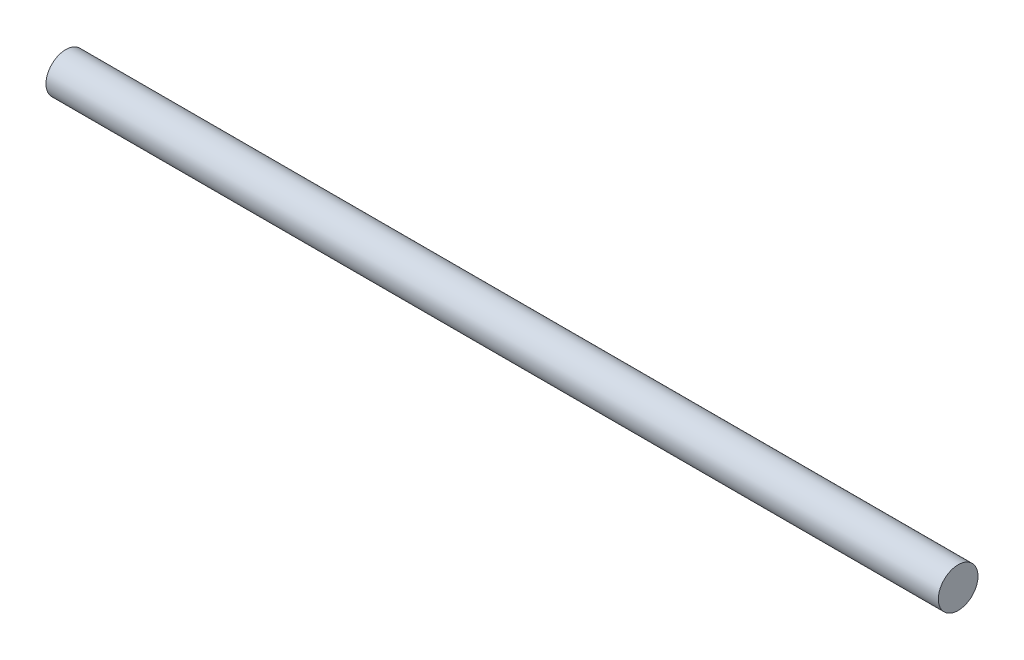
ISO-10303-21;
HEADER;
FILE_DESCRIPTION(('STEP AP214'),'2;1');
FILE_NAME('part.step','',(''),(''),'','','');
FILE_SCHEMA(('AUTOMOTIVE_DESIGN { 1 0 10303 214 1 1 1 1 }'));
ENDSEC;
DATA;
#1=APPLICATION_CONTEXT('core data for automotive mechanical design processes');
#2=APPLICATION_PROTOCOL_DEFINITION('international standard','automotive_design',2000,#1);
#3=PRODUCT_CONTEXT('',#1,'mechanical');
#4=PRODUCT('Part','Part','',(#3));
#5=PRODUCT_RELATED_PRODUCT_CATEGORY('part','',(#4));
#6=PRODUCT_DEFINITION_FORMATION('','',#4);
#7=PRODUCT_DEFINITION_CONTEXT('part definition',#1,'design');
#8=PRODUCT_DEFINITION('design','',#6,#7);
#9=PRODUCT_DEFINITION_SHAPE('','',#8);
#10=(LENGTH_UNIT() NAMED_UNIT(*) SI_UNIT(.MILLI.,.METRE.));
#11=(NAMED_UNIT(*) PLANE_ANGLE_UNIT() SI_UNIT($,.RADIAN.));
#12=(NAMED_UNIT(*) SI_UNIT($,.STERADIAN.) SOLID_ANGLE_UNIT());
#13=UNCERTAINTY_MEASURE_WITH_UNIT(LENGTH_MEASURE(1.E-05),#10,'distance_accuracy_value','');
#14=(GEOMETRIC_REPRESENTATION_CONTEXT(3) GLOBAL_UNCERTAINTY_ASSIGNED_CONTEXT((#13)) GLOBAL_UNIT_ASSIGNED_CONTEXT((#10,
#11,#12)) REPRESENTATION_CONTEXT('',''));
#15=CARTESIAN_POINT('',(0.,0.,0.));
#16=DIRECTION('',(0.,0.,1.));
#17=DIRECTION('',(1.,0.,0.));
#18=AXIS2_PLACEMENT_3D('',#15,#16,#17);
#19=CARTESIAN_POINT('',(270.,0.,0.));
#20=DIRECTION('',(-1.,0.,0.));
#21=DIRECTION('',(0.,0.,1.));
#22=AXIS2_PLACEMENT_3D('',#19,#20,#21);
#23=CYLINDRICAL_SURFACE('',#22,6.);
#24=CARTESIAN_POINT('',(270.,0.,0.));
#25=DIRECTION('',(1.,0.,0.));
#26=DIRECTION('',(0.,0.,-1.));
#27=AXIS2_PLACEMENT_3D('',#24,#25,#26);
#28=CIRCLE('',#27,6.);
#29=CARTESIAN_POINT('',(270.,0.,-6.));
#30=VERTEX_POINT('',#29);
#31=EDGE_CURVE('E10',#30,#30,#28,.T.);
#32=ORIENTED_EDGE('',*,*,#31,.F.);
#33=EDGE_LOOP('',(#32));
#34=FACE_BOUND('',#33,.T.);
#35=CARTESIAN_POINT('',(0.,0.,0.));
#36=DIRECTION('',(1.,0.,0.));
#37=DIRECTION('',(0.,0.,-1.));
#38=AXIS2_PLACEMENT_3D('',#35,#36,#37);
#39=CIRCLE('',#38,6.);
#40=CARTESIAN_POINT('',(0.,0.,-6.));
#41=VERTEX_POINT('',#40);
#42=EDGE_CURVE('E40',#41,#41,#39,.T.);
#43=ORIENTED_EDGE('',*,*,#42,.T.);
#44=EDGE_LOOP('',(#43));
#45=FACE_BOUND('',#44,.T.);
#46=ADVANCED_FACE('F37',(#34,#45),#23,.T.);
#47=CARTESIAN_POINT('',(270.,0.,0.));
#48=DIRECTION('',(1.,0.,0.));
#49=DIRECTION('',(0.,0.,-1.));
#50=AXIS2_PLACEMENT_3D('',#47,#48,#49);
#51=PLANE('',#50);
#52=ORIENTED_EDGE('',*,*,#31,.T.);
#53=EDGE_LOOP('',(#52));
#54=FACE_BOUND('',#53,.T.);
#55=ADVANCED_FACE('F52',(#54),#51,.T.);
#56=CARTESIAN_POINT('',(0.,0.,0.));
#57=DIRECTION('',(1.,0.,0.));
#58=DIRECTION('',(0.,0.,-1.));
#59=AXIS2_PLACEMENT_3D('',#56,#57,#58);
#60=PLANE('',#59);
#61=ORIENTED_EDGE('',*,*,#42,.F.);
#62=EDGE_LOOP('',(#61));
#63=FACE_BOUND('',#62,.T.);
#64=ADVANCED_FACE('F50',(#63),#60,.F.);
#65=CLOSED_SHELL('',(#46,#55,#64));
#66=MANIFOLD_SOLID_BREP('B2',#65);
#67=ADVANCED_BREP_SHAPE_REPRESENTATION('',(#18,#66),#14);
#68=SHAPE_DEFINITION_REPRESENTATION(#9,#67);
ENDSEC;
END-ISO-10303-21;
